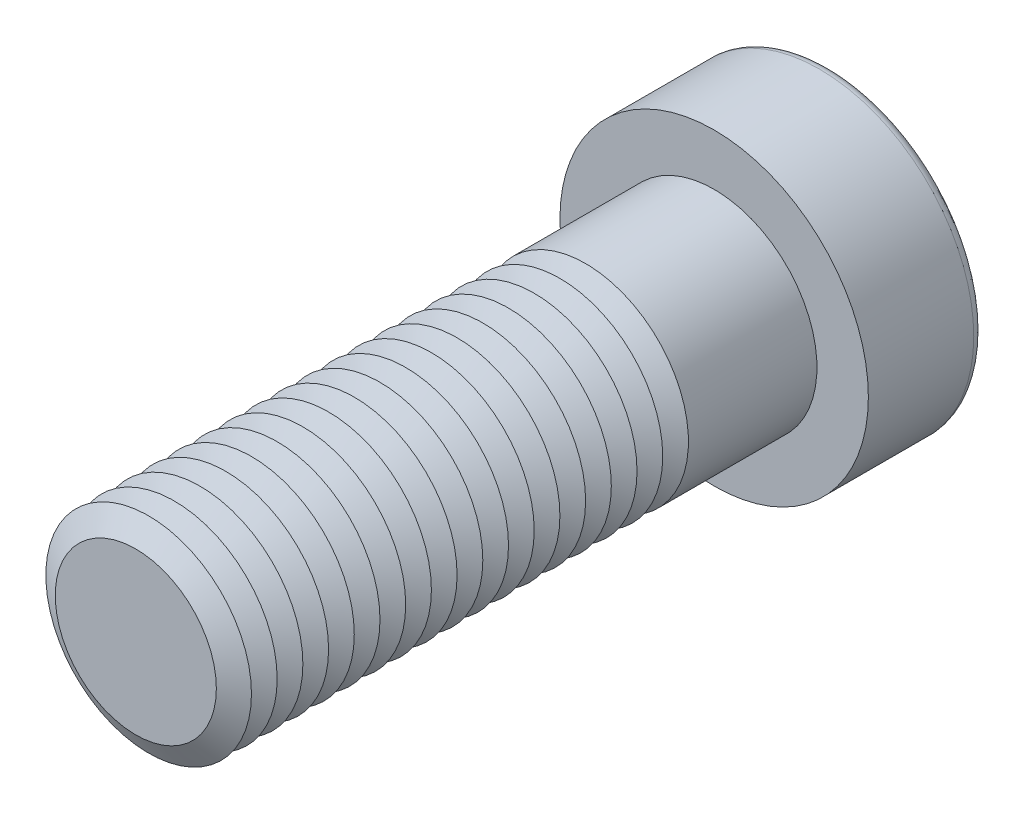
from build123d import *

# Parameters (mm, degrees)
SKETCH1_R           = 8
BOSS_EXTRUDE1_DEPTH = 45
SKETCH2_R           = 12
BOSS_EXTRUDE2_DEPTH = 9
CUT_EXTRUDE1_DEPTH  = 9
FILLET1_R           = 0.8
LPATTERN1_COUNT     = 18
LPATTERN1_PITCH     = 2


with BuildPart() as part:
    # Sketch1 → Boss-Extrude1 (new body)
    with BuildSketch(Plane.XY):
        with Locations(Location((0, 0, 0), (0, 0, 180))):
            Circle(SKETCH1_R)
    extrude(amount=BOSS_EXTRUDE1_DEPTH)

    # Sketch2 → Boss-Extrude2 (add)
    with BuildSketch(Plane(origin=(0, 0, 0), x_dir=(-1, 0, 0), z_dir=(0, 0, -1))):
        Circle(SKETCH2_R)
    extrude(amount=BOSS_EXTRUDE2_DEPTH)

    # Sketch3 → Cut-Extrude1 (cut)
    with BuildSketch(Plane(origin=(0, 0, -9), x_dir=(-1, 0, 0), z_dir=(0, 0, -1))):
        Polygon((-3.464101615, 6), (-6.92820323, 0), (-3.464101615, -6), (3.464101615, -6), (6.92820323, 0), (3.464101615, 6), align=None)
    extrude(amount=-CUT_EXTRUDE1_DEPTH, mode=Mode.SUBTRACT)

    # Fillet1
    fillet1_edges = [part.edges().sort_by_distance(p)[0] for p in [
        (12, 0, -9),
    ]]
    fillet(fillet1_edges, radius=FILLET1_R)

    # Cut-Extrude2 cone 1 section (on through the dimple's axis) → Cut-Extrude2 (revolve, cut)
    with BuildSketch(Plane.YZ):
        Polygon((0, 0), (6, 0), (0, 3.464101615), align=None)
    revolve(axis=Axis((0, 0, 0), (0, 0, 1)), mode=Mode.SUBTRACT)

    # Cut-Extrude3 cone 1 section (on through the dimple's axis) → Cut-Extrude3 (revolve, cut)
    with BuildSketch(Plane(origin=(0, 0, -9), x_dir=(0, 1, 0), z_dir=(1, 0, 0))):
        Polygon((0, 0), (6.92820323, 0), (0, 1.856406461), align=None)
    revolve(axis=Axis((0, 0, -9), (0, 0, 1)), mode=Mode.SUBTRACT)

    # Sketch7 → Cut-Revolve1 (revolve, cut)
    with BuildSketch(Plane(origin=(0, 0, 0), x_dir=(0, 0, -1), z_dir=(1, 0, 0)), mode=Mode.PRIVATE) as cut_revolve1_sk:
        Polygon((-45, 6.267949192), (-44, 8), (-46, 8), align=None)
    cut_revolve1 = revolve(cut_revolve1_sk.sketch.rotate(Axis((0, 0, 45), (0, 0, -1)), 270), axis=Axis((0, 0, 45), (0, 0, -1)), mode=Mode.SUBTRACT)

    # LPattern1: Cut-Revolve1 ×18
    with Locations(*[(0, 0, -i * LPATTERN1_PITCH) for i in range(1, LPATTERN1_COUNT)]):
        add(cut_revolve1, mode=Mode.SUBTRACT)


solid = part.part
